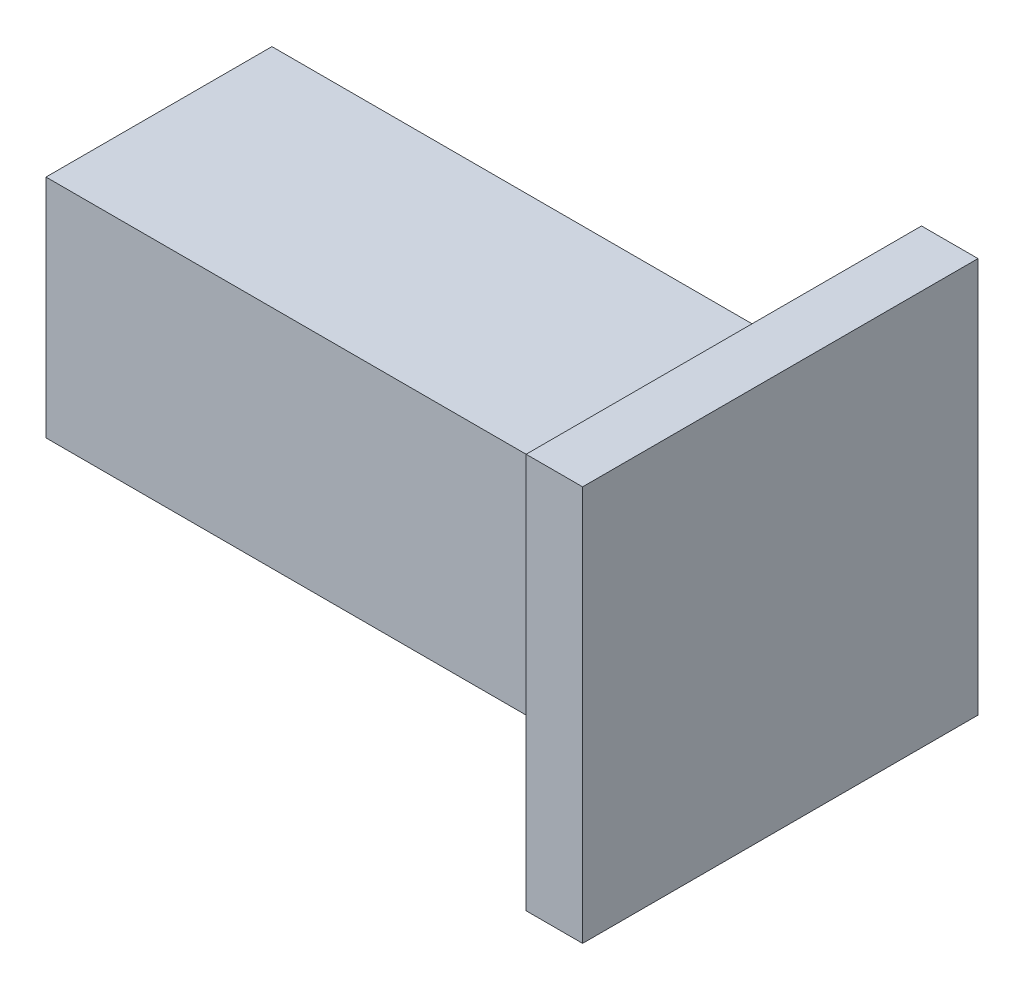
ISO-10303-21;
HEADER;
FILE_DESCRIPTION(('STEP AP214'),'2;1');
FILE_NAME('part.step','',(''),(''),'','','');
FILE_SCHEMA(('AUTOMOTIVE_DESIGN { 1 0 10303 214 1 1 1 1 }'));
ENDSEC;
DATA;
#1=APPLICATION_CONTEXT('core data for automotive mechanical design processes');
#2=APPLICATION_PROTOCOL_DEFINITION('international standard','automotive_design',2000,#1);
#3=PRODUCT_CONTEXT('',#1,'mechanical');
#4=PRODUCT('Part','Part','',(#3));
#5=PRODUCT_RELATED_PRODUCT_CATEGORY('part','',(#4));
#6=PRODUCT_DEFINITION_FORMATION('','',#4);
#7=PRODUCT_DEFINITION_CONTEXT('part definition',#1,'design');
#8=PRODUCT_DEFINITION('design','',#6,#7);
#9=PRODUCT_DEFINITION_SHAPE('','',#8);
#10=(LENGTH_UNIT() NAMED_UNIT(*) SI_UNIT(.MILLI.,.METRE.));
#11=(NAMED_UNIT(*) PLANE_ANGLE_UNIT() SI_UNIT($,.RADIAN.));
#12=(NAMED_UNIT(*) SI_UNIT($,.STERADIAN.) SOLID_ANGLE_UNIT());
#13=UNCERTAINTY_MEASURE_WITH_UNIT(LENGTH_MEASURE(1.E-05),#10,'distance_accuracy_value','');
#14=(GEOMETRIC_REPRESENTATION_CONTEXT(3) GLOBAL_UNCERTAINTY_ASSIGNED_CONTEXT((#13)) GLOBAL_UNIT_ASSIGNED_CONTEXT((#10,
#11,#12)) REPRESENTATION_CONTEXT('',''));
#15=CARTESIAN_POINT('',(0.,0.,0.));
#16=DIRECTION('',(0.,0.,1.));
#17=DIRECTION('',(1.,0.,0.));
#18=AXIS2_PLACEMENT_3D('',#15,#16,#17);
#19=CARTESIAN_POINT('',(0.,-118.91492552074,40.));
#20=DIRECTION('',(1.,0.,0.));
#21=DIRECTION('',(0.,1.,0.));
#22=AXIS2_PLACEMENT_3D('',#19,#20,#21);
#23=PLANE('',#22);
#24=DIRECTION('',(0.,-1.,0.));
#25=VECTOR('',#24,1.);
#26=CARTESIAN_POINT('',(0.,-118.91492552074,0.));
#27=LINE('',#26,#25);
#28=CARTESIAN_POINT('',(0.,-15.,0.));
#29=VERTEX_POINT('',#28);
#30=CARTESIAN_POINT('',(0.,-55.,0.));
#31=VERTEX_POINT('',#30);
#32=EDGE_CURVE('E137',#29,#31,#27,.T.);
#33=ORIENTED_EDGE('',*,*,#32,.T.);
#34=DIRECTION('',(0.,0.,-1.));
#35=VECTOR('',#34,1.);
#36=CARTESIAN_POINT('',(0.,-55.,40.));
#37=LINE('',#36,#35);
#38=CARTESIAN_POINT('',(0.,-55.,40.));
#39=VERTEX_POINT('',#38);
#40=EDGE_CURVE('E159',#39,#31,#37,.T.);
#41=ORIENTED_EDGE('',*,*,#40,.F.);
#42=DIRECTION('',(0.,-1.,0.));
#43=VECTOR('',#42,1.);
#44=CARTESIAN_POINT('',(0.,-118.91492552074,40.));
#45=LINE('',#44,#43);
#46=CARTESIAN_POINT('',(0.,-15.,40.));
#47=VERTEX_POINT('',#46);
#48=EDGE_CURVE('E146',#47,#39,#45,.T.);
#49=ORIENTED_EDGE('',*,*,#48,.F.);
#50=DIRECTION('',(0.,0.,-1.));
#51=VECTOR('',#50,1.);
#52=CARTESIAN_POINT('',(0.,-15.,40.));
#53=LINE('',#52,#51);
#54=EDGE_CURVE('E154',#47,#29,#53,.T.);
#55=ORIENTED_EDGE('',*,*,#54,.T.);
#56=EDGE_LOOP('',(#33,#41,#49,#55));
#57=FACE_BOUND('',#56,.T.);
#58=ADVANCED_FACE('F34',(#57),#23,.F.);
#59=CARTESIAN_POINT('',(50.,-55.,40.));
#60=DIRECTION('',(0.,1.,0.));
#61=DIRECTION('',(0.,0.,1.));
#62=AXIS2_PLACEMENT_3D('',#59,#60,#61);
#63=PLANE('',#62);
#64=DIRECTION('',(1.,0.,0.));
#65=VECTOR('',#64,1.);
#66=CARTESIAN_POINT('',(50.,-55.,0.));
#67=LINE('',#66,#65);
#68=CARTESIAN_POINT('',(97.,-55.,0.));
#69=VERTEX_POINT('',#68);
#70=EDGE_CURVE('E140',#31,#69,#67,.T.);
#71=ORIENTED_EDGE('',*,*,#70,.T.);
#72=DIRECTION('',(0.,0.,-1.));
#73=VECTOR('',#72,1.);
#74=CARTESIAN_POINT('',(97.,-55.,40.));
#75=LINE('',#74,#73);
#76=CARTESIAN_POINT('',(97.,-55.,40.));
#77=VERTEX_POINT('',#76);
#78=EDGE_CURVE('E43',#69,#77,#75,.F.);
#79=ORIENTED_EDGE('',*,*,#78,.T.);
#80=DIRECTION('',(1.,0.,0.));
#81=VECTOR('',#80,1.);
#82=CARTESIAN_POINT('',(50.,-55.,40.));
#83=LINE('',#82,#81);
#84=EDGE_CURVE('E149',#39,#77,#83,.T.);
#85=ORIENTED_EDGE('',*,*,#84,.F.);
#86=ORIENTED_EDGE('',*,*,#40,.T.);
#87=EDGE_LOOP('',(#71,#79,#85,#86));
#88=FACE_BOUND('',#87,.T.);
#89=ADVANCED_FACE('F218',(#88),#63,.F.);
#90=CARTESIAN_POINT('',(50.,-15.,40.));
#91=DIRECTION('',(0.,1.,0.));
#92=DIRECTION('',(-1.,0.,0.));
#93=AXIS2_PLACEMENT_3D('',#90,#91,#92);
#94=PLANE('',#93);
#95=DIRECTION('',(1.,0.,0.));
#96=VECTOR('',#95,1.);
#97=CARTESIAN_POINT('',(50.,-15.,40.));
#98=LINE('',#97,#96);
#99=CARTESIAN_POINT('',(97.,-15.,40.));
#100=VERTEX_POINT('',#99);
#101=EDGE_CURVE('E152',#47,#100,#98,.T.);
#102=ORIENTED_EDGE('',*,*,#101,.T.);
#103=DIRECTION('',(0.,0.,-1.));
#104=VECTOR('',#103,1.);
#105=CARTESIAN_POINT('',(97.,-15.,40.));
#106=LINE('',#105,#104);
#107=CARTESIAN_POINT('',(97.,-15.,0.));
#108=VERTEX_POINT('',#107);
#109=EDGE_CURVE('E162',#100,#108,#106,.T.);
#110=ORIENTED_EDGE('',*,*,#109,.T.);
#111=DIRECTION('',(1.,0.,0.));
#112=VECTOR('',#111,1.);
#113=CARTESIAN_POINT('',(50.,-15.,0.));
#114=LINE('',#113,#112);
#115=EDGE_CURVE('E150',#29,#108,#114,.T.);
#116=ORIENTED_EDGE('',*,*,#115,.F.);
#117=ORIENTED_EDGE('',*,*,#54,.F.);
#118=EDGE_LOOP('',(#102,#110,#116,#117));
#119=FACE_BOUND('',#118,.T.);
#120=ADVANCED_FACE('F224',(#119),#94,.T.);
#121=CARTESIAN_POINT('',(50.,-118.91492552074,40.));
#122=DIRECTION('',(0.,0.,1.));
#123=DIRECTION('',(1.,0.,0.));
#124=AXIS2_PLACEMENT_3D('',#121,#122,#123);
#125=PLANE('',#124);
#126=ORIENTED_EDGE('',*,*,#84,.T.);
#127=DIRECTION('',(0.,-1.,0.));
#128=VECTOR('',#127,1.);
#129=CARTESIAN_POINT('',(97.,-118.91492552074,40.));
#130=LINE('',#129,#128);
#131=EDGE_CURVE('E11',#77,#100,#130,.F.);
#132=ORIENTED_EDGE('',*,*,#131,.T.);
#133=ORIENTED_EDGE('',*,*,#101,.F.);
#134=ORIENTED_EDGE('',*,*,#48,.T.);
#135=EDGE_LOOP('',(#126,#132,#133,#134));
#136=FACE_BOUND('',#135,.T.);
#137=ADVANCED_FACE('F252',(#136),#125,.T.);
#138=CARTESIAN_POINT('',(50.,-118.91492552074,0.));
#139=DIRECTION('',(0.,0.,1.));
#140=DIRECTION('',(1.,0.,0.));
#141=AXIS2_PLACEMENT_3D('',#138,#139,#140);
#142=PLANE('',#141);
#143=ORIENTED_EDGE('',*,*,#115,.T.);
#144=DIRECTION('',(0.,-1.,0.));
#145=VECTOR('',#144,1.);
#146=CARTESIAN_POINT('',(97.,-55.,0.));
#147=LINE('',#146,#145);
#148=EDGE_CURVE('E58',#108,#69,#147,.T.);
#149=ORIENTED_EDGE('',*,*,#148,.T.);
#150=ORIENTED_EDGE('',*,*,#70,.F.);
#151=ORIENTED_EDGE('',*,*,#32,.F.);
#152=EDGE_LOOP('',(#143,#149,#150,#151));
#153=FACE_BOUND('',#152,.T.);
#154=ADVANCED_FACE('F258',(#153),#142,.F.);
#155=CARTESIAN_POINT('',(110.,0.,55.));
#156=DIRECTION('',(0.,0.,-1.));
#157=DIRECTION('',(0.,1.,0.));
#158=AXIS2_PLACEMENT_3D('',#155,#156,#157);
#159=PLANE('',#158);
#160=DIRECTION('',(0.,-1.,0.));
#161=VECTOR('',#160,1.);
#162=CARTESIAN_POINT('',(100.,0.,55.));
#163=LINE('',#162,#161);
#164=CARTESIAN_POINT('',(100.,0.,55.));
#165=VERTEX_POINT('',#164);
#166=CARTESIAN_POINT('',(100.,-70.,55.));
#167=VERTEX_POINT('',#166);
#168=EDGE_CURVE('E136',#165,#167,#163,.T.);
#169=ORIENTED_EDGE('',*,*,#168,.T.);
#170=DIRECTION('',(-1.,0.,0.));
#171=VECTOR('',#170,1.);
#172=CARTESIAN_POINT('',(110.,-70.,55.));
#173=LINE('',#172,#171);
#174=CARTESIAN_POINT('',(110.,-70.,55.));
#175=VERTEX_POINT('',#174);
#176=EDGE_CURVE('E116',#175,#167,#173,.T.);
#177=ORIENTED_EDGE('',*,*,#176,.F.);
#178=DIRECTION('',(0.,-1.,0.));
#179=VECTOR('',#178,1.);
#180=CARTESIAN_POINT('',(110.,0.,55.));
#181=LINE('',#180,#179);
#182=CARTESIAN_POINT('',(110.,0.,55.));
#183=VERTEX_POINT('',#182);
#184=EDGE_CURVE('E123',#183,#175,#181,.T.);
#185=ORIENTED_EDGE('',*,*,#184,.F.);
#186=DIRECTION('',(-1.,0.,0.));
#187=VECTOR('',#186,1.);
#188=CARTESIAN_POINT('',(110.,0.,55.));
#189=LINE('',#188,#187);
#190=EDGE_CURVE('E198',#183,#165,#189,.T.);
#191=ORIENTED_EDGE('',*,*,#190,.T.);
#192=EDGE_LOOP('',(#169,#177,#185,#191));
#193=FACE_BOUND('',#192,.T.);
#194=ADVANCED_FACE('F134',(#193),#159,.F.);
#195=CARTESIAN_POINT('',(110.,-70.,55.));
#196=DIRECTION('',(0.,1.,0.));
#197=DIRECTION('',(0.,0.,1.));
#198=AXIS2_PLACEMENT_3D('',#195,#196,#197);
#199=PLANE('',#198);
#200=DIRECTION('',(0.,0.,-1.));
#201=VECTOR('',#200,1.);
#202=CARTESIAN_POINT('',(100.,-70.,55.));
#203=LINE('',#202,#201);
#204=CARTESIAN_POINT('',(100.,-70.,-15.));
#205=VERTEX_POINT('',#204);
#206=EDGE_CURVE('E189',#167,#205,#203,.T.);
#207=ORIENTED_EDGE('',*,*,#206,.T.);
#208=DIRECTION('',(-1.,0.,0.));
#209=VECTOR('',#208,1.);
#210=CARTESIAN_POINT('',(110.,-70.,-15.));
#211=LINE('',#210,#209);
#212=CARTESIAN_POINT('',(110.,-70.,-15.));
#213=VERTEX_POINT('',#212);
#214=EDGE_CURVE('E119',#213,#205,#211,.T.);
#215=ORIENTED_EDGE('',*,*,#214,.F.);
#216=DIRECTION('',(0.,0.,-1.));
#217=VECTOR('',#216,1.);
#218=CARTESIAN_POINT('',(110.,-70.,55.));
#219=LINE('',#218,#217);
#220=EDGE_CURVE('E112',#175,#213,#219,.T.);
#221=ORIENTED_EDGE('',*,*,#220,.F.);
#222=ORIENTED_EDGE('',*,*,#176,.T.);
#223=EDGE_LOOP('',(#207,#215,#221,#222));
#224=FACE_BOUND('',#223,.T.);
#225=ADVANCED_FACE('F114',(#224),#199,.F.);
#226=CARTESIAN_POINT('',(110.,0.,-15.));
#227=DIRECTION('',(0.,0.,1.));
#228=DIRECTION('',(0.,-1.,0.));
#229=AXIS2_PLACEMENT_3D('',#226,#227,#228);
#230=PLANE('',#229);
#231=DIRECTION('',(0.,1.,0.));
#232=VECTOR('',#231,1.);
#233=CARTESIAN_POINT('',(100.,0.,-15.));
#234=LINE('',#233,#232);
#235=CARTESIAN_POINT('',(100.,0.,-15.));
#236=VERTEX_POINT('',#235);
#237=EDGE_CURVE('E191',#205,#236,#234,.T.);
#238=ORIENTED_EDGE('',*,*,#237,.T.);
#239=DIRECTION('',(-1.,0.,0.));
#240=VECTOR('',#239,1.);
#241=CARTESIAN_POINT('',(110.,0.,-15.));
#242=LINE('',#241,#240);
#243=CARTESIAN_POINT('',(110.,0.,-15.));
#244=VERTEX_POINT('',#243);
#245=EDGE_CURVE('E142',#244,#236,#242,.T.);
#246=ORIENTED_EDGE('',*,*,#245,.F.);
#247=DIRECTION('',(0.,1.,0.));
#248=VECTOR('',#247,1.);
#249=CARTESIAN_POINT('',(110.,0.,-15.));
#250=LINE('',#249,#248);
#251=EDGE_CURVE('E122',#213,#244,#250,.T.);
#252=ORIENTED_EDGE('',*,*,#251,.F.);
#253=ORIENTED_EDGE('',*,*,#214,.T.);
#254=EDGE_LOOP('',(#238,#246,#252,#253));
#255=FACE_BOUND('',#254,.T.);
#256=ADVANCED_FACE('F208',(#255),#230,.F.);
#257=CARTESIAN_POINT('',(110.,0.,55.));
#258=DIRECTION('',(0.,-1.,0.));
#259=DIRECTION('',(0.,0.,-1.));
#260=AXIS2_PLACEMENT_3D('',#257,#258,#259);
#261=PLANE('',#260);
#262=DIRECTION('',(0.,0.,1.));
#263=VECTOR('',#262,1.);
#264=CARTESIAN_POINT('',(100.,0.,55.));
#265=LINE('',#264,#263);
#266=EDGE_CURVE('E132',#236,#165,#265,.T.);
#267=ORIENTED_EDGE('',*,*,#266,.T.);
#268=ORIENTED_EDGE('',*,*,#190,.F.);
#269=DIRECTION('',(0.,0.,1.));
#270=VECTOR('',#269,1.);
#271=CARTESIAN_POINT('',(110.,0.,55.));
#272=LINE('',#271,#270);
#273=EDGE_CURVE('E128',#244,#183,#272,.T.);
#274=ORIENTED_EDGE('',*,*,#273,.F.);
#275=ORIENTED_EDGE('',*,*,#245,.T.);
#276=EDGE_LOOP('',(#267,#268,#274,#275));
#277=FACE_BOUND('',#276,.T.);
#278=ADVANCED_FACE('F203',(#277),#261,.F.);
#279=CARTESIAN_POINT('',(110.,-70.,55.));
#280=DIRECTION('',(1.,0.,0.));
#281=DIRECTION('',(0.,0.,-1.));
#282=AXIS2_PLACEMENT_3D('',#279,#280,#281);
#283=PLANE('',#282);
#284=ORIENTED_EDGE('',*,*,#184,.T.);
#285=ORIENTED_EDGE('',*,*,#220,.T.);
#286=ORIENTED_EDGE('',*,*,#251,.T.);
#287=ORIENTED_EDGE('',*,*,#273,.T.);
#288=EDGE_LOOP('',(#284,#285,#286,#287));
#289=FACE_BOUND('',#288,.T.);
#290=ADVANCED_FACE('F126',(#289),#283,.T.);
#291=CARTESIAN_POINT('',(100.,-70.,55.));
#292=DIRECTION('',(1.,0.,0.));
#293=DIRECTION('',(0.,0.,-1.));
#294=AXIS2_PLACEMENT_3D('',#291,#292,#293);
#295=PLANE('',#294);
#296=DIRECTION('',(0.,-1.,0.));
#297=VECTOR('',#296,1.);
#298=CARTESIAN_POINT('',(100.,-15.,-3.));
#299=LINE('',#298,#297);
#300=CARTESIAN_POINT('',(100.,-58.,-3.));
#301=VERTEX_POINT('',#300);
#302=CARTESIAN_POINT('',(100.,-12.,-3.));
#303=VERTEX_POINT('',#302);
#304=EDGE_CURVE('E169',#301,#303,#299,.F.);
#305=ORIENTED_EDGE('',*,*,#304,.T.);
#306=DIRECTION('',(0.,0.,-1.));
#307=VECTOR('',#306,1.);
#308=CARTESIAN_POINT('',(100.,-12.,55.));
#309=LINE('',#308,#307);
#310=CARTESIAN_POINT('',(100.,-12.,43.));
#311=VERTEX_POINT('',#310);
#312=EDGE_CURVE('E171',#303,#311,#309,.F.);
#313=ORIENTED_EDGE('',*,*,#312,.T.);
#314=DIRECTION('',(0.,-1.,0.));
#315=VECTOR('',#314,1.);
#316=CARTESIAN_POINT('',(100.,-70.,43.));
#317=LINE('',#316,#315);
#318=CARTESIAN_POINT('',(100.,-58.,43.));
#319=VERTEX_POINT('',#318);
#320=EDGE_CURVE('E165',#311,#319,#317,.T.);
#321=ORIENTED_EDGE('',*,*,#320,.T.);
#322=DIRECTION('',(0.,0.,-1.));
#323=VECTOR('',#322,1.);
#324=CARTESIAN_POINT('',(100.,-58.,0.));
#325=LINE('',#324,#323);
#326=EDGE_CURVE('E167',#319,#301,#325,.T.);
#327=ORIENTED_EDGE('',*,*,#326,.T.);
#328=EDGE_LOOP('',(#305,#313,#321,#327));
#329=FACE_BOUND('',#328,.T.);
#330=ORIENTED_EDGE('',*,*,#168,.F.);
#331=ORIENTED_EDGE('',*,*,#266,.F.);
#332=ORIENTED_EDGE('',*,*,#237,.F.);
#333=ORIENTED_EDGE('',*,*,#206,.F.);
#334=EDGE_LOOP('',(#330,#331,#332,#333));
#335=FACE_BOUND('',#334,.T.);
#336=ADVANCED_FACE('F207',(#329,#335),#295,.F.);
#337=CARTESIAN_POINT('',(97.,-58.,55.));
#338=DIRECTION('',(0.,0.,1.));
#339=DIRECTION('',(1.,0.,0.));
#340=AXIS2_PLACEMENT_3D('',#337,#338,#339);
#341=CYLINDRICAL_SURFACE('',#340,3.);
#342=CARTESIAN_POINT('',(97.,-58.,-3.));
#343=DIRECTION('',(0.,-0.707106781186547,0.707106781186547));
#344=DIRECTION('',(0.,0.707106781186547,0.707106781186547));
#345=AXIS2_PLACEMENT_3D('',#342,#343,#344);
#346=ELLIPSE('',#345,4.24264068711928,3.);
#347=EDGE_CURVE('E179',#301,#69,#346,.T.);
#348=ORIENTED_EDGE('',*,*,#347,.F.);
#349=ORIENTED_EDGE('',*,*,#326,.F.);
#350=CARTESIAN_POINT('',(97.,-58.,43.));
#351=DIRECTION('',(0.,-0.707106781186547,-0.707106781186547));
#352=DIRECTION('',(0.,-0.707106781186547,0.707106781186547));
#353=AXIS2_PLACEMENT_3D('',#350,#351,#352);
#354=ELLIPSE('',#353,4.24264068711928,3.);
#355=EDGE_CURVE('E38',#77,#319,#354,.T.);
#356=ORIENTED_EDGE('',*,*,#355,.F.);
#357=ORIENTED_EDGE('',*,*,#78,.F.);
#358=EDGE_LOOP('',(#348,#349,#356,#357));
#359=FACE_BOUND('',#358,.T.);
#360=ADVANCED_FACE('F36',(#359),#341,.F.);
#361=CARTESIAN_POINT('',(97.,-70.,43.));
#362=DIRECTION('',(0.,-1.,0.));
#363=DIRECTION('',(0.,0.,-1.));
#364=AXIS2_PLACEMENT_3D('',#361,#362,#363);
#365=CYLINDRICAL_SURFACE('',#364,3.);
#366=ORIENTED_EDGE('',*,*,#355,.T.);
#367=ORIENTED_EDGE('',*,*,#320,.F.);
#368=CARTESIAN_POINT('',(97.,-12.,43.));
#369=DIRECTION('',(0.,-0.707106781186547,0.707106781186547));
#370=DIRECTION('',(0.,-0.707106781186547,-0.707106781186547));
#371=AXIS2_PLACEMENT_3D('',#368,#369,#370);
#372=ELLIPSE('',#371,4.24264068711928,3.);
#373=EDGE_CURVE('E178',#100,#311,#372,.T.);
#374=ORIENTED_EDGE('',*,*,#373,.F.);
#375=ORIENTED_EDGE('',*,*,#131,.F.);
#376=EDGE_LOOP('',(#366,#367,#374,#375));
#377=FACE_BOUND('',#376,.T.);
#378=ADVANCED_FACE('F234',(#377),#365,.F.);
#379=CARTESIAN_POINT('',(97.,-118.91492552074,-3.));
#380=DIRECTION('',(0.,1.,0.));
#381=DIRECTION('',(0.,0.,1.));
#382=AXIS2_PLACEMENT_3D('',#379,#380,#381);
#383=CYLINDRICAL_SURFACE('',#382,3.);
#384=ORIENTED_EDGE('',*,*,#347,.T.);
#385=ORIENTED_EDGE('',*,*,#148,.F.);
#386=CARTESIAN_POINT('',(97.,-12.,-3.));
#387=DIRECTION('',(0.,0.707106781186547,0.707106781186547));
#388=DIRECTION('',(0.,0.707106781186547,-0.707106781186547));
#389=AXIS2_PLACEMENT_3D('',#386,#387,#388);
#390=ELLIPSE('',#389,4.24264068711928,3.);
#391=EDGE_CURVE('E176',#303,#108,#390,.F.);
#392=ORIENTED_EDGE('',*,*,#391,.F.);
#393=ORIENTED_EDGE('',*,*,#304,.F.);
#394=EDGE_LOOP('',(#384,#385,#392,#393));
#395=FACE_BOUND('',#394,.T.);
#396=ADVANCED_FACE('F231',(#395),#383,.F.);
#397=CARTESIAN_POINT('',(97.,-12.,40.));
#398=DIRECTION('',(0.,0.,-1.));
#399=DIRECTION('',(-1.,0.,0.));
#400=AXIS2_PLACEMENT_3D('',#397,#398,#399);
#401=CYLINDRICAL_SURFACE('',#400,3.);
#402=ORIENTED_EDGE('',*,*,#373,.T.);
#403=ORIENTED_EDGE('',*,*,#312,.F.);
#404=ORIENTED_EDGE('',*,*,#391,.T.);
#405=ORIENTED_EDGE('',*,*,#109,.F.);
#406=EDGE_LOOP('',(#402,#403,#404,#405));
#407=FACE_BOUND('',#406,.T.);
#408=ADVANCED_FACE('F228',(#407),#401,.F.);
#409=CLOSED_SHELL('',(#58,#89,#120,#137,#154,#194,#225,#256,#278,#290,#336,#360,#378,#396,#408));
#410=MANIFOLD_SOLID_BREP('B2',#409);
#411=ADVANCED_BREP_SHAPE_REPRESENTATION('',(#18,#410),#14);
#412=SHAPE_DEFINITION_REPRESENTATION(#9,#411);
ENDSEC;
END-ISO-10303-21;
